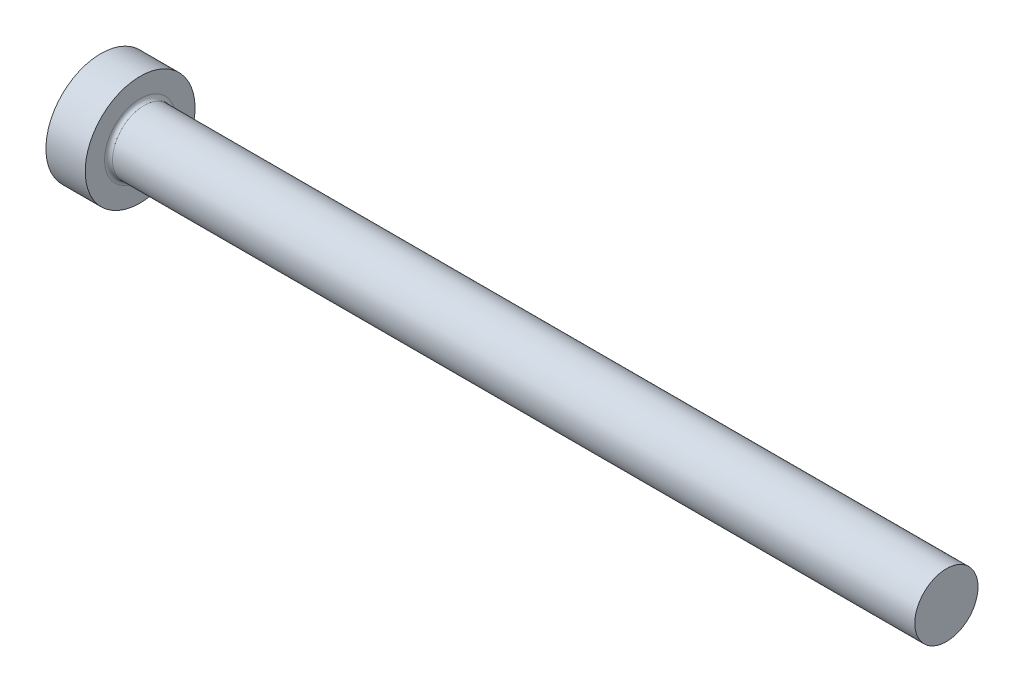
ISO-10303-21;
HEADER;
FILE_DESCRIPTION(('STEP AP214'),'2;1');
FILE_NAME('part.step','',(''),(''),'','','');
FILE_SCHEMA(('AUTOMOTIVE_DESIGN { 1 0 10303 214 1 1 1 1 }'));
ENDSEC;
DATA;
#1=APPLICATION_CONTEXT('core data for automotive mechanical design processes');
#2=APPLICATION_PROTOCOL_DEFINITION('international standard','automotive_design',2000,#1);
#3=PRODUCT_CONTEXT('',#1,'mechanical');
#4=PRODUCT('Part','Part','',(#3));
#5=PRODUCT_RELATED_PRODUCT_CATEGORY('part','',(#4));
#6=PRODUCT_DEFINITION_FORMATION('','',#4);
#7=PRODUCT_DEFINITION_CONTEXT('part definition',#1,'design');
#8=PRODUCT_DEFINITION('design','',#6,#7);
#9=PRODUCT_DEFINITION_SHAPE('','',#8);
#10=(LENGTH_UNIT() NAMED_UNIT(*) SI_UNIT(.MILLI.,.METRE.));
#11=(NAMED_UNIT(*) PLANE_ANGLE_UNIT() SI_UNIT($,.RADIAN.));
#12=(NAMED_UNIT(*) SI_UNIT($,.STERADIAN.) SOLID_ANGLE_UNIT());
#13=UNCERTAINTY_MEASURE_WITH_UNIT(LENGTH_MEASURE(1.E-05),#10,'distance_accuracy_value','');
#14=(GEOMETRIC_REPRESENTATION_CONTEXT(3) GLOBAL_UNCERTAINTY_ASSIGNED_CONTEXT((#13)) GLOBAL_UNIT_ASSIGNED_CONTEXT((#10,
#11,#12)) REPRESENTATION_CONTEXT('',''));
#15=CARTESIAN_POINT('',(0.,0.,0.));
#16=DIRECTION('',(0.,0.,1.));
#17=DIRECTION('',(1.,0.,0.));
#18=AXIS2_PLACEMENT_3D('',#15,#16,#17);
#19=CARTESIAN_POINT('',(0.,3.475,0.));
#20=DIRECTION('',(-1.,0.,0.));
#21=DIRECTION('',(0.,0.,1.));
#22=AXIS2_PLACEMENT_3D('',#19,#20,#21);
#23=PLANE('',#22);
#24=CARTESIAN_POINT('',(0.,0.,0.));
#25=DIRECTION('',(1.,0.,0.));
#26=DIRECTION('',(0.,0.,-1.));
#27=AXIS2_PLACEMENT_3D('',#24,#25,#26);
#28=CIRCLE('',#27,6.95);
#29=CARTESIAN_POINT('',(0.,0.,-6.95));
#30=VERTEX_POINT('',#29);
#31=EDGE_CURVE('E18',#30,#30,#28,.T.);
#32=ORIENTED_EDGE('',*,*,#31,.F.);
#33=EDGE_LOOP('',(#32));
#34=FACE_BOUND('',#33,.T.);
#35=ADVANCED_FACE('F15',(#34),#23,.T.);
#36=CARTESIAN_POINT('',(2.48749999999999,0.,0.));
#37=DIRECTION('',(1.,0.,0.));
#38=DIRECTION('',(0.,0.,-1.));
#39=AXIS2_PLACEMENT_3D('',#36,#37,#38);
#40=CYLINDRICAL_SURFACE('',#39,6.95);
#41=ORIENTED_EDGE('',*,*,#31,.T.);
#42=EDGE_LOOP('',(#41));
#43=FACE_BOUND('',#42,.T.);
#44=CARTESIAN_POINT('',(4.975,0.,0.));
#45=DIRECTION('',(1.,0.,0.));
#46=DIRECTION('',(0.,0.,-1.));
#47=AXIS2_PLACEMENT_3D('',#44,#45,#46);
#48=CIRCLE('',#47,6.95);
#49=CARTESIAN_POINT('',(4.975,0.,-6.95));
#50=VERTEX_POINT('',#49);
#51=EDGE_CURVE('E56',#50,#50,#48,.T.);
#52=ORIENTED_EDGE('',*,*,#51,.F.);
#53=EDGE_LOOP('',(#52));
#54=FACE_BOUND('',#53,.T.);
#55=ADVANCED_FACE('F63',(#43,#54),#40,.T.);
#56=CARTESIAN_POINT('',(4.975,5.725,0.));
#57=DIRECTION('',(1.,0.,0.));
#58=DIRECTION('',(0.,0.,-1.));
#59=AXIS2_PLACEMENT_3D('',#56,#57,#58);
#60=PLANE('',#59);
#61=CARTESIAN_POINT('',(4.975,0.,0.));
#62=DIRECTION('',(1.,0.,0.));
#63=DIRECTION('',(0.,1.,0.));
#64=AXIS2_PLACEMENT_3D('',#61,#62,#63);
#65=CIRCLE('',#64,4.5);
#66=CARTESIAN_POINT('',(4.975,4.5,0.));
#67=VERTEX_POINT('',#66);
#68=EDGE_CURVE('E27',#67,#67,#65,.F.);
#69=ORIENTED_EDGE('',*,*,#68,.T.);
#70=EDGE_LOOP('',(#69));
#71=FACE_BOUND('',#70,.T.);
#72=ORIENTED_EDGE('',*,*,#51,.T.);
#73=EDGE_LOOP('',(#72));
#74=FACE_BOUND('',#73,.T.);
#75=ADVANCED_FACE('F71',(#71,#74),#60,.T.);
#76=CARTESIAN_POINT('',(107.,2.00000000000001,0.));
#77=DIRECTION('',(1.,0.,0.));
#78=DIRECTION('',(0.,0.,-1.));
#79=AXIS2_PLACEMENT_3D('',#76,#77,#78);
#80=PLANE('',#79);
#81=CARTESIAN_POINT('',(107.,0.,0.));
#82=DIRECTION('',(1.,0.,0.));
#83=DIRECTION('',(0.,0.,-1.));
#84=AXIS2_PLACEMENT_3D('',#81,#82,#83);
#85=CIRCLE('',#84,4.00000000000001);
#86=CARTESIAN_POINT('',(107.,0.,-4.00000000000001));
#87=VERTEX_POINT('',#86);
#88=EDGE_CURVE('E22',#87,#87,#85,.F.);
#89=ORIENTED_EDGE('',*,*,#88,.F.);
#90=EDGE_LOOP('',(#89));
#91=FACE_BOUND('',#90,.T.);
#92=ADVANCED_FACE('F43',(#91),#80,.T.);
#93=CARTESIAN_POINT('',(5.475,0.,0.));
#94=DIRECTION('',(1.,0.,0.));
#95=DIRECTION('',(0.,0.,-1.));
#96=AXIS2_PLACEMENT_3D('',#93,#94,#95);
#97=TOROIDAL_SURFACE('',#96,4.5,0.5);
#98=ORIENTED_EDGE('',*,*,#68,.F.);
#99=EDGE_LOOP('',(#98));
#100=FACE_BOUND('',#99,.T.);
#101=CARTESIAN_POINT('',(5.475,0.,0.));
#102=DIRECTION('',(1.,0.,0.));
#103=DIRECTION('',(0.,0.,-1.));
#104=AXIS2_PLACEMENT_3D('',#101,#102,#103);
#105=CIRCLE('',#104,4.00000000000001);
#106=CARTESIAN_POINT('',(5.475,0.,-4.00000000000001));
#107=VERTEX_POINT('',#106);
#108=EDGE_CURVE('E10',#107,#107,#105,.T.);
#109=ORIENTED_EDGE('',*,*,#108,.F.);
#110=EDGE_LOOP('',(#109));
#111=FACE_BOUND('',#110,.T.);
#112=ADVANCED_FACE('F37',(#100,#111),#97,.F.);
#113=CARTESIAN_POINT('',(56.2375,0.,0.));
#114=DIRECTION('',(1.,0.,0.));
#115=DIRECTION('',(0.,0.,-1.));
#116=AXIS2_PLACEMENT_3D('',#113,#114,#115);
#117=CYLINDRICAL_SURFACE('',#116,4.00000000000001);
#118=ORIENTED_EDGE('',*,*,#108,.T.);
#119=EDGE_LOOP('',(#118));
#120=FACE_BOUND('',#119,.T.);
#121=ORIENTED_EDGE('',*,*,#88,.T.);
#122=EDGE_LOOP('',(#121));
#123=FACE_BOUND('',#122,.T.);
#124=ADVANCED_FACE('F42',(#120,#123),#117,.T.);
#125=CLOSED_SHELL('',(#35,#55,#75,#92,#112,#124));
#126=MANIFOLD_SOLID_BREP('B1',#125);
#127=ADVANCED_BREP_SHAPE_REPRESENTATION('',(#18,#126),#14);
#128=SHAPE_DEFINITION_REPRESENTATION(#9,#127);
ENDSEC;
END-ISO-10303-21;
